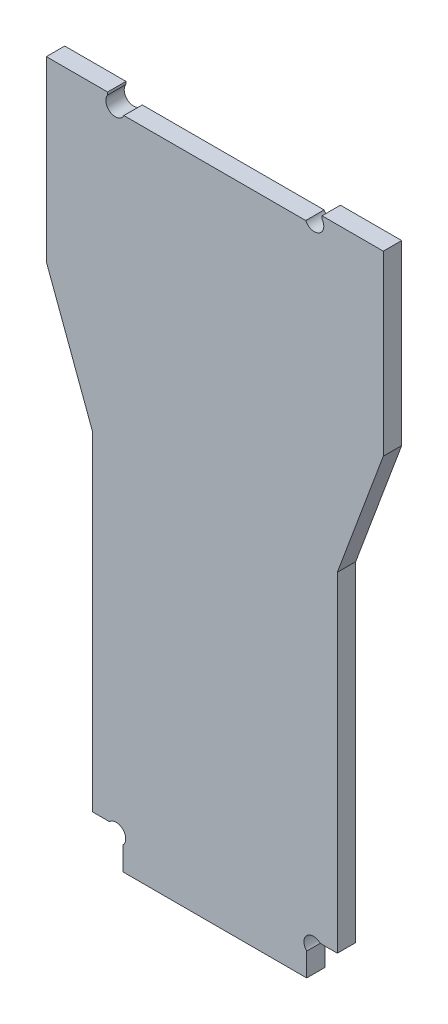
ISO-10303-21;
HEADER;
FILE_DESCRIPTION(('STEP AP214'),'2;1');
FILE_NAME('part.step','',(''),(''),'','','');
FILE_SCHEMA(('AUTOMOTIVE_DESIGN { 1 0 10303 214 1 1 1 1 }'));
ENDSEC;
DATA;
#1=APPLICATION_CONTEXT('core data for automotive mechanical design processes');
#2=APPLICATION_PROTOCOL_DEFINITION('international standard','automotive_design',2000,#1);
#3=PRODUCT_CONTEXT('',#1,'mechanical');
#4=PRODUCT('Part','Part','',(#3));
#5=PRODUCT_RELATED_PRODUCT_CATEGORY('part','',(#4));
#6=PRODUCT_DEFINITION_FORMATION('','',#4);
#7=PRODUCT_DEFINITION_CONTEXT('part definition',#1,'design');
#8=PRODUCT_DEFINITION('design','',#6,#7);
#9=PRODUCT_DEFINITION_SHAPE('','',#8);
#10=(LENGTH_UNIT() NAMED_UNIT(*) SI_UNIT(.MILLI.,.METRE.));
#11=(NAMED_UNIT(*) PLANE_ANGLE_UNIT() SI_UNIT($,.RADIAN.));
#12=(NAMED_UNIT(*) SI_UNIT($,.STERADIAN.) SOLID_ANGLE_UNIT());
#13=UNCERTAINTY_MEASURE_WITH_UNIT(LENGTH_MEASURE(1.E-05),#10,'distance_accuracy_value','');
#14=(GEOMETRIC_REPRESENTATION_CONTEXT(3) GLOBAL_UNCERTAINTY_ASSIGNED_CONTEXT((#13)) GLOBAL_UNIT_ASSIGNED_CONTEXT((#10,
#11,#12)) REPRESENTATION_CONTEXT('',''));
#15=CARTESIAN_POINT('',(0.,0.,0.));
#16=DIRECTION('',(0.,0.,1.));
#17=DIRECTION('',(1.,0.,0.));
#18=AXIS2_PLACEMENT_3D('',#15,#16,#17);
#19=CARTESIAN_POINT('',(25.,80.,3.));
#20=DIRECTION('',(0.937139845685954,0.348954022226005,0.));
#21=DIRECTION('',(-0.348954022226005,0.937139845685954,0.));
#22=AXIS2_PLACEMENT_3D('',#19,#20,#21);
#23=PLANE('',#22);
#24=DIRECTION('',(0.348954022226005,-0.937139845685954,0.));
#25=VECTOR('',#24,1.);
#26=CARTESIAN_POINT('',(25.,80.,0.));
#27=LINE('',#26,#25);
#28=CARTESIAN_POINT('',(25.,80.,0.));
#29=VERTEX_POINT('',#28);
#30=CARTESIAN_POINT('',(32.5,59.8582380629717,0.));
#31=VERTEX_POINT('',#30);
#32=EDGE_CURVE('E166',#29,#31,#27,.T.);
#33=ORIENTED_EDGE('',*,*,#32,.T.);
#34=DIRECTION('',(0.,0.,-1.));
#35=VECTOR('',#34,1.);
#36=CARTESIAN_POINT('',(32.5,59.8582380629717,3.));
#37=LINE('',#36,#35);
#38=CARTESIAN_POINT('',(32.5,59.8582380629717,3.));
#39=VERTEX_POINT('',#38);
#40=EDGE_CURVE('E11',#39,#31,#37,.T.);
#41=ORIENTED_EDGE('',*,*,#40,.F.);
#42=DIRECTION('',(0.348954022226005,-0.937139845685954,0.));
#43=VECTOR('',#42,1.);
#44=CARTESIAN_POINT('',(25.,80.,3.));
#45=LINE('',#44,#43);
#46=CARTESIAN_POINT('',(25.,80.,3.));
#47=VERTEX_POINT('',#46);
#48=EDGE_CURVE('E217',#47,#39,#45,.T.);
#49=ORIENTED_EDGE('',*,*,#48,.F.);
#50=DIRECTION('',(0.,0.,-1.));
#51=VECTOR('',#50,1.);
#52=CARTESIAN_POINT('',(25.,80.,3.));
#53=LINE('',#52,#51);
#54=EDGE_CURVE('E179',#47,#29,#53,.T.);
#55=ORIENTED_EDGE('',*,*,#54,.T.);
#56=EDGE_LOOP('',(#33,#41,#49,#55));
#57=FACE_BOUND('',#56,.T.);
#58=ADVANCED_FACE('F26',(#57),#23,.F.);
#59=CARTESIAN_POINT('',(32.5,6.,3.));
#60=DIRECTION('',(1.,0.,0.));
#61=DIRECTION('',(0.,0.,-1.));
#62=AXIS2_PLACEMENT_3D('',#59,#60,#61);
#63=PLANE('',#62);
#64=DIRECTION('',(0.,-1.,0.));
#65=VECTOR('',#64,1.);
#66=CARTESIAN_POINT('',(32.5,6.,0.));
#67=LINE('',#66,#65);
#68=CARTESIAN_POINT('',(32.5,6.,0.));
#69=VERTEX_POINT('',#68);
#70=EDGE_CURVE('E162',#31,#69,#67,.T.);
#71=ORIENTED_EDGE('',*,*,#70,.T.);
#72=DIRECTION('',(0.,0.,-1.));
#73=VECTOR('',#72,1.);
#74=CARTESIAN_POINT('',(32.5,6.,3.));
#75=LINE('',#74,#73);
#76=CARTESIAN_POINT('',(32.5,6.,3.));
#77=VERTEX_POINT('',#76);
#78=EDGE_CURVE('E33',#77,#69,#75,.T.);
#79=ORIENTED_EDGE('',*,*,#78,.F.);
#80=DIRECTION('',(0.,-1.,0.));
#81=VECTOR('',#80,1.);
#82=CARTESIAN_POINT('',(32.5,6.,3.));
#83=LINE('',#82,#81);
#84=EDGE_CURVE('E175',#39,#77,#83,.T.);
#85=ORIENTED_EDGE('',*,*,#84,.F.);
#86=ORIENTED_EDGE('',*,*,#40,.T.);
#87=EDGE_LOOP('',(#71,#79,#85,#86));
#88=FACE_BOUND('',#87,.T.);
#89=ADVANCED_FACE('F174',(#88),#63,.F.);
#90=CARTESIAN_POINT('',(35.3079689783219,6.,3.));
#91=DIRECTION('',(0.,1.,0.));
#92=DIRECTION('',(0.,0.,1.));
#93=AXIS2_PLACEMENT_3D('',#90,#91,#92);
#94=PLANE('',#93);
#95=DIRECTION('',(1.,0.,0.));
#96=VECTOR('',#95,1.);
#97=CARTESIAN_POINT('',(35.3079689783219,6.,0.));
#98=LINE('',#97,#96);
#99=CARTESIAN_POINT('',(35.3079689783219,6.,0.));
#100=VERTEX_POINT('',#99);
#101=EDGE_CURVE('E168',#69,#100,#98,.T.);
#102=ORIENTED_EDGE('',*,*,#101,.T.);
#103=DIRECTION('',(0.,0.,-1.));
#104=VECTOR('',#103,1.);
#105=CARTESIAN_POINT('',(35.3079689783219,6.,3.));
#106=LINE('',#105,#104);
#107=CARTESIAN_POINT('',(35.3079689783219,6.,3.));
#108=VERTEX_POINT('',#107);
#109=EDGE_CURVE('E303',#108,#100,#106,.T.);
#110=ORIENTED_EDGE('',*,*,#109,.F.);
#111=DIRECTION('',(1.,0.,0.));
#112=VECTOR('',#111,1.);
#113=CARTESIAN_POINT('',(35.3079689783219,6.,3.));
#114=LINE('',#113,#112);
#115=EDGE_CURVE('E220',#77,#108,#114,.T.);
#116=ORIENTED_EDGE('',*,*,#115,.F.);
#117=ORIENTED_EDGE('',*,*,#78,.T.);
#118=EDGE_LOOP('',(#102,#110,#116,#117));
#119=FACE_BOUND('',#118,.T.);
#120=ADVANCED_FACE('F307',(#119),#94,.F.);
#121=CARTESIAN_POINT('',(36.403984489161,4.90398448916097,3.));
#122=DIRECTION('',(0.,0.,-1.));
#123=DIRECTION('',(-1.,0.,0.));
#124=AXIS2_PLACEMENT_3D('',#121,#122,#123);
#125=CYLINDRICAL_SURFACE('',#124,1.54999999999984);
#126=CARTESIAN_POINT('',(36.403984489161,4.90398448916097,0.));
#127=DIRECTION('',(0.,0.,-1.));
#128=DIRECTION('',(1.,0.,0.));
#129=AXIS2_PLACEMENT_3D('',#126,#127,#128);
#130=CIRCLE('',#129,1.54999999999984);
#131=CARTESIAN_POINT('',(37.5,3.80796897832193,0.));
#132=VERTEX_POINT('',#131);
#133=EDGE_CURVE('E183',#100,#132,#130,.T.);
#134=ORIENTED_EDGE('',*,*,#133,.T.);
#135=DIRECTION('',(0.,0.,-1.));
#136=VECTOR('',#135,1.);
#137=CARTESIAN_POINT('',(37.5,3.80796897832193,3.));
#138=LINE('',#137,#136);
#139=CARTESIAN_POINT('',(37.5,3.80796897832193,3.));
#140=VERTEX_POINT('',#139);
#141=EDGE_CURVE('E300',#140,#132,#138,.T.);
#142=ORIENTED_EDGE('',*,*,#141,.F.);
#143=CARTESIAN_POINT('',(36.403984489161,4.90398448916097,3.));
#144=DIRECTION('',(0.,0.,-1.));
#145=DIRECTION('',(1.,0.,0.));
#146=AXIS2_PLACEMENT_3D('',#143,#144,#145);
#147=CIRCLE('',#146,1.54999999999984);
#148=EDGE_CURVE('E222',#108,#140,#147,.T.);
#149=ORIENTED_EDGE('',*,*,#148,.F.);
#150=ORIENTED_EDGE('',*,*,#109,.T.);
#151=EDGE_LOOP('',(#134,#142,#149,#150));
#152=FACE_BOUND('',#151,.T.);
#153=ADVANCED_FACE('F315',(#152),#125,.F.);
#154=CARTESIAN_POINT('',(37.5,0.,3.));
#155=DIRECTION('',(1.,0.,0.));
#156=DIRECTION('',(0.,1.,0.));
#157=AXIS2_PLACEMENT_3D('',#154,#155,#156);
#158=PLANE('',#157);
#159=DIRECTION('',(0.,-1.,0.));
#160=VECTOR('',#159,1.);
#161=CARTESIAN_POINT('',(37.5,0.,0.));
#162=LINE('',#161,#160);
#163=CARTESIAN_POINT('',(37.5,0.,0.));
#164=VERTEX_POINT('',#163);
#165=EDGE_CURVE('E185',#132,#164,#162,.T.);
#166=ORIENTED_EDGE('',*,*,#165,.T.);
#167=DIRECTION('',(0.,0.,-1.));
#168=VECTOR('',#167,1.);
#169=CARTESIAN_POINT('',(37.5,0.,3.));
#170=LINE('',#169,#168);
#171=CARTESIAN_POINT('',(37.5,0.,3.));
#172=VERTEX_POINT('',#171);
#173=EDGE_CURVE('E297',#172,#164,#170,.T.);
#174=ORIENTED_EDGE('',*,*,#173,.F.);
#175=DIRECTION('',(0.,-1.,0.));
#176=VECTOR('',#175,1.);
#177=CARTESIAN_POINT('',(37.5,0.,3.));
#178=LINE('',#177,#176);
#179=EDGE_CURVE('E224',#140,#172,#178,.T.);
#180=ORIENTED_EDGE('',*,*,#179,.F.);
#181=ORIENTED_EDGE('',*,*,#141,.T.);
#182=EDGE_LOOP('',(#166,#174,#180,#181));
#183=FACE_BOUND('',#182,.T.);
#184=ADVANCED_FACE('F318',(#183),#158,.F.);
#185=CARTESIAN_POINT('',(67.5,0.,3.));
#186=DIRECTION('',(0.,1.,0.));
#187=DIRECTION('',(-1.,0.,0.));
#188=AXIS2_PLACEMENT_3D('',#185,#186,#187);
#189=PLANE('',#188);
#190=DIRECTION('',(1.,0.,0.));
#191=VECTOR('',#190,1.);
#192=CARTESIAN_POINT('',(67.5,0.,0.));
#193=LINE('',#192,#191);
#194=CARTESIAN_POINT('',(67.5,0.,0.));
#195=VERTEX_POINT('',#194);
#196=EDGE_CURVE('E187',#164,#195,#193,.T.);
#197=ORIENTED_EDGE('',*,*,#196,.T.);
#198=DIRECTION('',(0.,0.,-1.));
#199=VECTOR('',#198,1.);
#200=CARTESIAN_POINT('',(67.5,0.,3.));
#201=LINE('',#200,#199);
#202=CARTESIAN_POINT('',(67.5,0.,3.));
#203=VERTEX_POINT('',#202);
#204=EDGE_CURVE('E294',#203,#195,#201,.T.);
#205=ORIENTED_EDGE('',*,*,#204,.F.);
#206=DIRECTION('',(1.,0.,0.));
#207=VECTOR('',#206,1.);
#208=CARTESIAN_POINT('',(67.5,0.,3.));
#209=LINE('',#208,#207);
#210=EDGE_CURVE('E226',#172,#203,#209,.T.);
#211=ORIENTED_EDGE('',*,*,#210,.F.);
#212=ORIENTED_EDGE('',*,*,#173,.T.);
#213=EDGE_LOOP('',(#197,#205,#211,#212));
#214=FACE_BOUND('',#213,.T.);
#215=ADVANCED_FACE('F323',(#214),#189,.F.);
#216=CARTESIAN_POINT('',(67.5,0.,3.));
#217=DIRECTION('',(-1.,0.,0.));
#218=DIRECTION('',(0.,0.,1.));
#219=AXIS2_PLACEMENT_3D('',#216,#217,#218);
#220=PLANE('',#219);
#221=DIRECTION('',(0.,1.,0.));
#222=VECTOR('',#221,1.);
#223=CARTESIAN_POINT('',(67.5,0.,0.));
#224=LINE('',#223,#222);
#225=CARTESIAN_POINT('',(67.5,3.80796897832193,0.));
#226=VERTEX_POINT('',#225);
#227=EDGE_CURVE('E189',#195,#226,#224,.T.);
#228=ORIENTED_EDGE('',*,*,#227,.T.);
#229=DIRECTION('',(0.,0.,-1.));
#230=VECTOR('',#229,1.);
#231=CARTESIAN_POINT('',(67.5,3.80796897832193,3.));
#232=LINE('',#231,#230);
#233=CARTESIAN_POINT('',(67.5,3.80796897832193,3.));
#234=VERTEX_POINT('',#233);
#235=EDGE_CURVE('E291',#234,#226,#232,.T.);
#236=ORIENTED_EDGE('',*,*,#235,.F.);
#237=DIRECTION('',(0.,1.,0.));
#238=VECTOR('',#237,1.);
#239=CARTESIAN_POINT('',(67.5,0.,3.));
#240=LINE('',#239,#238);
#241=EDGE_CURVE('E228',#203,#234,#240,.T.);
#242=ORIENTED_EDGE('',*,*,#241,.F.);
#243=ORIENTED_EDGE('',*,*,#204,.T.);
#244=EDGE_LOOP('',(#228,#236,#242,#243));
#245=FACE_BOUND('',#244,.T.);
#246=ADVANCED_FACE('F329',(#245),#220,.F.);
#247=CARTESIAN_POINT('',(68.596015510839,4.90398448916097,3.));
#248=DIRECTION('',(0.,0.,-1.));
#249=DIRECTION('',(-1.,0.,0.));
#250=AXIS2_PLACEMENT_3D('',#247,#248,#249);
#251=CYLINDRICAL_SURFACE('',#250,1.54999999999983);
#252=CARTESIAN_POINT('',(68.596015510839,4.90398448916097,0.));
#253=DIRECTION('',(0.,0.,-1.));
#254=DIRECTION('',(-1.,0.,0.));
#255=AXIS2_PLACEMENT_3D('',#252,#253,#254);
#256=CIRCLE('',#255,1.54999999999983);
#257=CARTESIAN_POINT('',(69.692031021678,6.,0.));
#258=VERTEX_POINT('',#257);
#259=EDGE_CURVE('E191',#226,#258,#256,.T.);
#260=ORIENTED_EDGE('',*,*,#259,.T.);
#261=DIRECTION('',(0.,0.,-1.));
#262=VECTOR('',#261,1.);
#263=CARTESIAN_POINT('',(69.692031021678,6.,3.));
#264=LINE('',#263,#262);
#265=CARTESIAN_POINT('',(69.692031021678,6.,3.));
#266=VERTEX_POINT('',#265);
#267=EDGE_CURVE('E288',#266,#258,#264,.T.);
#268=ORIENTED_EDGE('',*,*,#267,.F.);
#269=CARTESIAN_POINT('',(68.596015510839,4.90398448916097,3.));
#270=DIRECTION('',(0.,0.,-1.));
#271=DIRECTION('',(-1.,0.,0.));
#272=AXIS2_PLACEMENT_3D('',#269,#270,#271);
#273=CIRCLE('',#272,1.54999999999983);
#274=EDGE_CURVE('E230',#234,#266,#273,.T.);
#275=ORIENTED_EDGE('',*,*,#274,.F.);
#276=ORIENTED_EDGE('',*,*,#235,.T.);
#277=EDGE_LOOP('',(#260,#268,#275,#276));
#278=FACE_BOUND('',#277,.T.);
#279=ADVANCED_FACE('F333',(#278),#251,.F.);
#280=CARTESIAN_POINT('',(69.692031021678,6.,3.));
#281=DIRECTION('',(0.,1.,0.));
#282=DIRECTION('',(0.,0.,1.));
#283=AXIS2_PLACEMENT_3D('',#280,#281,#282);
#284=PLANE('',#283);
#285=DIRECTION('',(1.,0.,0.));
#286=VECTOR('',#285,1.);
#287=CARTESIAN_POINT('',(69.692031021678,6.,0.));
#288=LINE('',#287,#286);
#289=CARTESIAN_POINT('',(72.5,6.,0.));
#290=VERTEX_POINT('',#289);
#291=EDGE_CURVE('E193',#258,#290,#288,.T.);
#292=ORIENTED_EDGE('',*,*,#291,.T.);
#293=DIRECTION('',(0.,0.,-1.));
#294=VECTOR('',#293,1.);
#295=CARTESIAN_POINT('',(72.5,6.,3.));
#296=LINE('',#295,#294);
#297=CARTESIAN_POINT('',(72.5,6.,3.));
#298=VERTEX_POINT('',#297);
#299=EDGE_CURVE('E285',#298,#290,#296,.T.);
#300=ORIENTED_EDGE('',*,*,#299,.F.);
#301=DIRECTION('',(1.,0.,0.));
#302=VECTOR('',#301,1.);
#303=CARTESIAN_POINT('',(69.692031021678,6.,3.));
#304=LINE('',#303,#302);
#305=EDGE_CURVE('E232',#266,#298,#304,.T.);
#306=ORIENTED_EDGE('',*,*,#305,.F.);
#307=ORIENTED_EDGE('',*,*,#267,.T.);
#308=EDGE_LOOP('',(#292,#300,#306,#307));
#309=FACE_BOUND('',#308,.T.);
#310=ADVANCED_FACE('F338',(#309),#284,.F.);
#311=CARTESIAN_POINT('',(72.5,6.,3.));
#312=DIRECTION('',(-1.,0.,0.));
#313=DIRECTION('',(0.,0.,1.));
#314=AXIS2_PLACEMENT_3D('',#311,#312,#313);
#315=PLANE('',#314);
#316=DIRECTION('',(0.,1.,0.));
#317=VECTOR('',#316,1.);
#318=CARTESIAN_POINT('',(72.5,6.,0.));
#319=LINE('',#318,#317);
#320=CARTESIAN_POINT('',(72.5,59.8582380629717,0.));
#321=VERTEX_POINT('',#320);
#322=EDGE_CURVE('E195',#290,#321,#319,.T.);
#323=ORIENTED_EDGE('',*,*,#322,.T.);
#324=DIRECTION('',(0.,0.,-1.));
#325=VECTOR('',#324,1.);
#326=CARTESIAN_POINT('',(72.5,59.8582380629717,3.));
#327=LINE('',#326,#325);
#328=CARTESIAN_POINT('',(72.5,59.8582380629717,3.));
#329=VERTEX_POINT('',#328);
#330=EDGE_CURVE('E282',#329,#321,#327,.T.);
#331=ORIENTED_EDGE('',*,*,#330,.F.);
#332=DIRECTION('',(0.,1.,0.));
#333=VECTOR('',#332,1.);
#334=CARTESIAN_POINT('',(72.5,6.,3.));
#335=LINE('',#334,#333);
#336=EDGE_CURVE('E234',#298,#329,#335,.T.);
#337=ORIENTED_EDGE('',*,*,#336,.F.);
#338=ORIENTED_EDGE('',*,*,#299,.T.);
#339=EDGE_LOOP('',(#323,#331,#337,#338));
#340=FACE_BOUND('',#339,.T.);
#341=ADVANCED_FACE('F344',(#340),#315,.F.);
#342=CARTESIAN_POINT('',(80.,80.,3.));
#343=DIRECTION('',(-0.937139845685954,0.348954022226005,0.));
#344=DIRECTION('',(-0.348954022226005,-0.937139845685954,0.));
#345=AXIS2_PLACEMENT_3D('',#342,#343,#344);
#346=PLANE('',#345);
#347=DIRECTION('',(0.348954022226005,0.937139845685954,0.));
#348=VECTOR('',#347,1.);
#349=CARTESIAN_POINT('',(80.,80.,0.));
#350=LINE('',#349,#348);
#351=CARTESIAN_POINT('',(80.,80.,0.));
#352=VERTEX_POINT('',#351);
#353=EDGE_CURVE('E197',#321,#352,#350,.T.);
#354=ORIENTED_EDGE('',*,*,#353,.T.);
#355=DIRECTION('',(0.,0.,-1.));
#356=VECTOR('',#355,1.);
#357=CARTESIAN_POINT('',(80.,80.,3.));
#358=LINE('',#357,#356);
#359=CARTESIAN_POINT('',(80.,80.,3.));
#360=VERTEX_POINT('',#359);
#361=EDGE_CURVE('E279',#360,#352,#358,.T.);
#362=ORIENTED_EDGE('',*,*,#361,.F.);
#363=DIRECTION('',(0.348954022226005,0.937139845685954,0.));
#364=VECTOR('',#363,1.);
#365=CARTESIAN_POINT('',(80.,80.,3.));
#366=LINE('',#365,#364);
#367=EDGE_CURVE('E236',#329,#360,#366,.T.);
#368=ORIENTED_EDGE('',*,*,#367,.F.);
#369=ORIENTED_EDGE('',*,*,#330,.T.);
#370=EDGE_LOOP('',(#354,#362,#368,#369));
#371=FACE_BOUND('',#370,.T.);
#372=ADVANCED_FACE('F348',(#371),#346,.F.);
#373=CARTESIAN_POINT('',(80.,109.,3.));
#374=DIRECTION('',(-1.,0.,0.));
#375=DIRECTION('',(0.,0.,1.));
#376=AXIS2_PLACEMENT_3D('',#373,#374,#375);
#377=PLANE('',#376);
#378=DIRECTION('',(0.,1.,0.));
#379=VECTOR('',#378,1.);
#380=CARTESIAN_POINT('',(80.,109.,0.));
#381=LINE('',#380,#379);
#382=CARTESIAN_POINT('',(80.,109.,0.));
#383=VERTEX_POINT('',#382);
#384=EDGE_CURVE('E199',#352,#383,#381,.T.);
#385=ORIENTED_EDGE('',*,*,#384,.T.);
#386=DIRECTION('',(0.,0.,-1.));
#387=VECTOR('',#386,1.);
#388=CARTESIAN_POINT('',(80.,109.,3.));
#389=LINE('',#388,#387);
#390=CARTESIAN_POINT('',(80.,109.,3.));
#391=VERTEX_POINT('',#390);
#392=EDGE_CURVE('E276',#391,#383,#389,.T.);
#393=ORIENTED_EDGE('',*,*,#392,.F.);
#394=DIRECTION('',(0.,1.,0.));
#395=VECTOR('',#394,1.);
#396=CARTESIAN_POINT('',(80.,109.,3.));
#397=LINE('',#396,#395);
#398=EDGE_CURVE('E238',#360,#391,#397,.T.);
#399=ORIENTED_EDGE('',*,*,#398,.F.);
#400=ORIENTED_EDGE('',*,*,#361,.T.);
#401=EDGE_LOOP('',(#385,#393,#399,#400));
#402=FACE_BOUND('',#401,.T.);
#403=ADVANCED_FACE('F353',(#402),#377,.F.);
#404=CARTESIAN_POINT('',(70.,109.,3.));
#405=DIRECTION('',(0.,-1.,0.));
#406=DIRECTION('',(0.,0.,-1.));
#407=AXIS2_PLACEMENT_3D('',#404,#405,#406);
#408=PLANE('',#407);
#409=DIRECTION('',(-1.,0.,0.));
#410=VECTOR('',#409,1.);
#411=CARTESIAN_POINT('',(70.,109.,0.));
#412=LINE('',#411,#410);
#413=CARTESIAN_POINT('',(70.,109.,0.));
#414=VERTEX_POINT('',#413);
#415=EDGE_CURVE('E201',#383,#414,#412,.T.);
#416=ORIENTED_EDGE('',*,*,#415,.T.);
#417=DIRECTION('',(0.,0.,-1.));
#418=VECTOR('',#417,1.);
#419=CARTESIAN_POINT('',(70.,109.,3.));
#420=LINE('',#419,#418);
#421=CARTESIAN_POINT('',(70.,109.,3.));
#422=VERTEX_POINT('',#421);
#423=EDGE_CURVE('E273',#422,#414,#420,.T.);
#424=ORIENTED_EDGE('',*,*,#423,.F.);
#425=DIRECTION('',(-1.,0.,0.));
#426=VECTOR('',#425,1.);
#427=CARTESIAN_POINT('',(70.,109.,3.));
#428=LINE('',#427,#426);
#429=EDGE_CURVE('E240',#391,#422,#428,.T.);
#430=ORIENTED_EDGE('',*,*,#429,.F.);
#431=ORIENTED_EDGE('',*,*,#392,.T.);
#432=EDGE_LOOP('',(#416,#424,#430,#431));
#433=FACE_BOUND('',#432,.T.);
#434=ADVANCED_FACE('F359',(#433),#408,.F.);
#435=CARTESIAN_POINT('',(70.,109.,3.));
#436=DIRECTION('',(1.,0.,0.));
#437=DIRECTION('',(0.,0.,-1.));
#438=AXIS2_PLACEMENT_3D('',#435,#436,#437);
#439=PLANE('',#438);
#440=DIRECTION('',(0.,-1.,0.));
#441=VECTOR('',#440,1.);
#442=CARTESIAN_POINT('',(70.,109.,0.));
#443=LINE('',#442,#441);
#444=CARTESIAN_POINT('',(70.,108.574329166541,0.));
#445=VERTEX_POINT('',#444);
#446=EDGE_CURVE('E203',#414,#445,#443,.T.);
#447=ORIENTED_EDGE('',*,*,#446,.T.);
#448=DIRECTION('',(0.,0.,-1.));
#449=VECTOR('',#448,1.);
#450=CARTESIAN_POINT('',(70.,108.574329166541,3.));
#451=LINE('',#450,#449);
#452=CARTESIAN_POINT('',(70.,108.574329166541,3.));
#453=VERTEX_POINT('',#452);
#454=EDGE_CURVE('E270',#453,#445,#451,.T.);
#455=ORIENTED_EDGE('',*,*,#454,.F.);
#456=DIRECTION('',(0.,-1.,0.));
#457=VECTOR('',#456,1.);
#458=CARTESIAN_POINT('',(70.,109.,3.));
#459=LINE('',#458,#457);
#460=EDGE_CURVE('E242',#422,#453,#459,.T.);
#461=ORIENTED_EDGE('',*,*,#460,.F.);
#462=ORIENTED_EDGE('',*,*,#423,.T.);
#463=EDGE_LOOP('',(#447,#455,#461,#462));
#464=FACE_BOUND('',#463,.T.);
#465=ADVANCED_FACE('F363',(#464),#439,.F.);
#466=CARTESIAN_POINT('',(68.7391374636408,107.672816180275,3.));
#467=DIRECTION('',(0.,0.,-1.));
#468=DIRECTION('',(-1.,0.,0.));
#469=AXIS2_PLACEMENT_3D('',#466,#467,#468);
#470=CYLINDRICAL_SURFACE('',#469,1.55);
#471=CARTESIAN_POINT('',(68.7391374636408,107.672816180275,0.));
#472=DIRECTION('',(0.,0.,-1.));
#473=DIRECTION('',(-1.,0.,0.));
#474=AXIS2_PLACEMENT_3D('',#471,#472,#473);
#475=CIRCLE('',#474,1.55);
#476=CARTESIAN_POINT('',(67.342778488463,107.,0.));
#477=VERTEX_POINT('',#476);
#478=EDGE_CURVE('E205',#445,#477,#475,.T.);
#479=ORIENTED_EDGE('',*,*,#478,.T.);
#480=DIRECTION('',(0.,0.,-1.));
#481=VECTOR('',#480,1.);
#482=CARTESIAN_POINT('',(67.342778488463,107.,3.));
#483=LINE('',#482,#481);
#484=CARTESIAN_POINT('',(67.342778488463,107.,3.));
#485=VERTEX_POINT('',#484);
#486=EDGE_CURVE('E267',#485,#477,#483,.T.);
#487=ORIENTED_EDGE('',*,*,#486,.F.);
#488=CARTESIAN_POINT('',(68.7391374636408,107.672816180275,3.));
#489=DIRECTION('',(0.,0.,-1.));
#490=DIRECTION('',(-1.,0.,0.));
#491=AXIS2_PLACEMENT_3D('',#488,#489,#490);
#492=CIRCLE('',#491,1.55);
#493=EDGE_CURVE('E244',#453,#485,#492,.T.);
#494=ORIENTED_EDGE('',*,*,#493,.F.);
#495=ORIENTED_EDGE('',*,*,#454,.T.);
#496=EDGE_LOOP('',(#479,#487,#494,#495));
#497=FACE_BOUND('',#496,.T.);
#498=ADVANCED_FACE('F368',(#497),#470,.F.);
#499=CARTESIAN_POINT('',(37.657221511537,107.,3.));
#500=DIRECTION('',(0.,-1.,0.));
#501=DIRECTION('',(0.,0.,-1.));
#502=AXIS2_PLACEMENT_3D('',#499,#500,#501);
#503=PLANE('',#502);
#504=DIRECTION('',(-1.,0.,0.));
#505=VECTOR('',#504,1.);
#506=CARTESIAN_POINT('',(37.657221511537,107.,0.));
#507=LINE('',#506,#505);
#508=CARTESIAN_POINT('',(37.657221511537,107.,0.));
#509=VERTEX_POINT('',#508);
#510=EDGE_CURVE('E207',#477,#509,#507,.T.);
#511=ORIENTED_EDGE('',*,*,#510,.T.);
#512=DIRECTION('',(0.,0.,-1.));
#513=VECTOR('',#512,1.);
#514=CARTESIAN_POINT('',(37.657221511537,107.,3.));
#515=LINE('',#514,#513);
#516=CARTESIAN_POINT('',(37.657221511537,107.,3.));
#517=VERTEX_POINT('',#516);
#518=EDGE_CURVE('E264',#517,#509,#515,.T.);
#519=ORIENTED_EDGE('',*,*,#518,.F.);
#520=DIRECTION('',(-1.,0.,0.));
#521=VECTOR('',#520,1.);
#522=CARTESIAN_POINT('',(37.657221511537,107.,3.));
#523=LINE('',#522,#521);
#524=EDGE_CURVE('E246',#485,#517,#523,.T.);
#525=ORIENTED_EDGE('',*,*,#524,.F.);
#526=ORIENTED_EDGE('',*,*,#486,.T.);
#527=EDGE_LOOP('',(#511,#519,#525,#526));
#528=FACE_BOUND('',#527,.T.);
#529=ADVANCED_FACE('F374',(#528),#503,.F.);
#530=CARTESIAN_POINT('',(36.2608625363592,107.672816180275,3.));
#531=DIRECTION('',(0.,0.,-1.));
#532=DIRECTION('',(-1.,0.,0.));
#533=AXIS2_PLACEMENT_3D('',#530,#531,#532);
#534=CYLINDRICAL_SURFACE('',#533,1.55);
#535=CARTESIAN_POINT('',(36.2608625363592,107.672816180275,0.));
#536=DIRECTION('',(0.,0.,-1.));
#537=DIRECTION('',(1.,0.,0.));
#538=AXIS2_PLACEMENT_3D('',#535,#536,#537);
#539=CIRCLE('',#538,1.55);
#540=CARTESIAN_POINT('',(35.,108.574329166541,0.));
#541=VERTEX_POINT('',#540);
#542=EDGE_CURVE('E209',#509,#541,#539,.T.);
#543=ORIENTED_EDGE('',*,*,#542,.T.);
#544=DIRECTION('',(0.,0.,-1.));
#545=VECTOR('',#544,1.);
#546=CARTESIAN_POINT('',(35.,108.574329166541,3.));
#547=LINE('',#546,#545);
#548=CARTESIAN_POINT('',(35.,108.574329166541,3.));
#549=VERTEX_POINT('',#548);
#550=EDGE_CURVE('E261',#549,#541,#547,.T.);
#551=ORIENTED_EDGE('',*,*,#550,.F.);
#552=CARTESIAN_POINT('',(36.2608625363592,107.672816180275,3.));
#553=DIRECTION('',(0.,0.,-1.));
#554=DIRECTION('',(1.,0.,0.));
#555=AXIS2_PLACEMENT_3D('',#552,#553,#554);
#556=CIRCLE('',#555,1.55);
#557=EDGE_CURVE('E248',#517,#549,#556,.T.);
#558=ORIENTED_EDGE('',*,*,#557,.F.);
#559=ORIENTED_EDGE('',*,*,#518,.T.);
#560=EDGE_LOOP('',(#543,#551,#558,#559));
#561=FACE_BOUND('',#560,.T.);
#562=ADVANCED_FACE('F378',(#561),#534,.F.);
#563=CARTESIAN_POINT('',(35.,109.,3.));
#564=DIRECTION('',(-1.,0.,0.));
#565=DIRECTION('',(0.,0.,1.));
#566=AXIS2_PLACEMENT_3D('',#563,#564,#565);
#567=PLANE('',#566);
#568=DIRECTION('',(0.,1.,0.));
#569=VECTOR('',#568,1.);
#570=CARTESIAN_POINT('',(35.,109.,0.));
#571=LINE('',#570,#569);
#572=CARTESIAN_POINT('',(35.,109.,0.));
#573=VERTEX_POINT('',#572);
#574=EDGE_CURVE('E211',#541,#573,#571,.T.);
#575=ORIENTED_EDGE('',*,*,#574,.T.);
#576=DIRECTION('',(0.,0.,-1.));
#577=VECTOR('',#576,1.);
#578=CARTESIAN_POINT('',(35.,109.,3.));
#579=LINE('',#578,#577);
#580=CARTESIAN_POINT('',(35.,109.,3.));
#581=VERTEX_POINT('',#580);
#582=EDGE_CURVE('E258',#581,#573,#579,.T.);
#583=ORIENTED_EDGE('',*,*,#582,.F.);
#584=DIRECTION('',(0.,1.,0.));
#585=VECTOR('',#584,1.);
#586=CARTESIAN_POINT('',(35.,109.,3.));
#587=LINE('',#586,#585);
#588=EDGE_CURVE('E250',#549,#581,#587,.T.);
#589=ORIENTED_EDGE('',*,*,#588,.F.);
#590=ORIENTED_EDGE('',*,*,#550,.T.);
#591=EDGE_LOOP('',(#575,#583,#589,#590));
#592=FACE_BOUND('',#591,.T.);
#593=ADVANCED_FACE('F383',(#592),#567,.F.);
#594=CARTESIAN_POINT('',(35.,109.,3.));
#595=DIRECTION('',(0.,-1.,0.));
#596=DIRECTION('',(0.,0.,-1.));
#597=AXIS2_PLACEMENT_3D('',#594,#595,#596);
#598=PLANE('',#597);
#599=DIRECTION('',(-1.,0.,0.));
#600=VECTOR('',#599,1.);
#601=CARTESIAN_POINT('',(35.,109.,0.));
#602=LINE('',#601,#600);
#603=CARTESIAN_POINT('',(25.,109.,0.));
#604=VERTEX_POINT('',#603);
#605=EDGE_CURVE('E213',#573,#604,#602,.T.);
#606=ORIENTED_EDGE('',*,*,#605,.T.);
#607=DIRECTION('',(0.,0.,-1.));
#608=VECTOR('',#607,1.);
#609=CARTESIAN_POINT('',(25.,109.,3.));
#610=LINE('',#609,#608);
#611=CARTESIAN_POINT('',(25.,109.,3.));
#612=VERTEX_POINT('',#611);
#613=EDGE_CURVE('E255',#612,#604,#610,.T.);
#614=ORIENTED_EDGE('',*,*,#613,.F.);
#615=DIRECTION('',(-1.,0.,0.));
#616=VECTOR('',#615,1.);
#617=CARTESIAN_POINT('',(35.,109.,3.));
#618=LINE('',#617,#616);
#619=EDGE_CURVE('E45',#581,#612,#618,.T.);
#620=ORIENTED_EDGE('',*,*,#619,.F.);
#621=ORIENTED_EDGE('',*,*,#582,.T.);
#622=EDGE_LOOP('',(#606,#614,#620,#621));
#623=FACE_BOUND('',#622,.T.);
#624=ADVANCED_FACE('F386',(#623),#598,.F.);
#625=CARTESIAN_POINT('',(25.,109.,3.));
#626=DIRECTION('',(1.,0.,0.));
#627=DIRECTION('',(0.,0.,-1.));
#628=AXIS2_PLACEMENT_3D('',#625,#626,#627);
#629=PLANE('',#628);
#630=DIRECTION('',(0.,-1.,0.));
#631=VECTOR('',#630,1.);
#632=CARTESIAN_POINT('',(25.,109.,0.));
#633=LINE('',#632,#631);
#634=EDGE_CURVE('E215',#604,#29,#633,.T.);
#635=ORIENTED_EDGE('',*,*,#634,.T.);
#636=ORIENTED_EDGE('',*,*,#54,.F.);
#637=DIRECTION('',(0.,-1.,0.));
#638=VECTOR('',#637,1.);
#639=CARTESIAN_POINT('',(25.,109.,3.));
#640=LINE('',#639,#638);
#641=EDGE_CURVE('E40',#612,#47,#640,.T.);
#642=ORIENTED_EDGE('',*,*,#641,.F.);
#643=ORIENTED_EDGE('',*,*,#613,.T.);
#644=EDGE_LOOP('',(#635,#636,#642,#643));
#645=FACE_BOUND('',#644,.T.);
#646=ADVANCED_FACE('F388',(#645),#629,.F.);
#647=CARTESIAN_POINT('',(36.403984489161,4.90398448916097,3.));
#648=DIRECTION('',(0.,0.,1.));
#649=DIRECTION('',(1.,0.,0.));
#650=AXIS2_PLACEMENT_3D('',#647,#648,#649);
#651=PLANE('',#650);
#652=ORIENTED_EDGE('',*,*,#48,.T.);
#653=ORIENTED_EDGE('',*,*,#84,.T.);
#654=ORIENTED_EDGE('',*,*,#115,.T.);
#655=ORIENTED_EDGE('',*,*,#148,.T.);
#656=ORIENTED_EDGE('',*,*,#179,.T.);
#657=ORIENTED_EDGE('',*,*,#210,.T.);
#658=ORIENTED_EDGE('',*,*,#241,.T.);
#659=ORIENTED_EDGE('',*,*,#274,.T.);
#660=ORIENTED_EDGE('',*,*,#305,.T.);
#661=ORIENTED_EDGE('',*,*,#336,.T.);
#662=ORIENTED_EDGE('',*,*,#367,.T.);
#663=ORIENTED_EDGE('',*,*,#398,.T.);
#664=ORIENTED_EDGE('',*,*,#429,.T.);
#665=ORIENTED_EDGE('',*,*,#460,.T.);
#666=ORIENTED_EDGE('',*,*,#493,.T.);
#667=ORIENTED_EDGE('',*,*,#524,.T.);
#668=ORIENTED_EDGE('',*,*,#557,.T.);
#669=ORIENTED_EDGE('',*,*,#588,.T.);
#670=ORIENTED_EDGE('',*,*,#619,.T.);
#671=ORIENTED_EDGE('',*,*,#641,.T.);
#672=EDGE_LOOP('',(#652,#653,#654,#655,#656,#657,#658,#659,#660,#661,#662,#663,#664,#665,#666,
#667,#668,#669,#670,#671));
#673=FACE_BOUND('',#672,.T.);
#674=ADVANCED_FACE('F310',(#673),#651,.T.);
#675=CARTESIAN_POINT('',(36.403984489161,4.90398448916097,0.));
#676=DIRECTION('',(0.,0.,1.));
#677=DIRECTION('',(1.,0.,0.));
#678=AXIS2_PLACEMENT_3D('',#675,#676,#677);
#679=PLANE('',#678);
#680=ORIENTED_EDGE('',*,*,#32,.F.);
#681=ORIENTED_EDGE('',*,*,#634,.F.);
#682=ORIENTED_EDGE('',*,*,#605,.F.);
#683=ORIENTED_EDGE('',*,*,#574,.F.);
#684=ORIENTED_EDGE('',*,*,#542,.F.);
#685=ORIENTED_EDGE('',*,*,#510,.F.);
#686=ORIENTED_EDGE('',*,*,#478,.F.);
#687=ORIENTED_EDGE('',*,*,#446,.F.);
#688=ORIENTED_EDGE('',*,*,#415,.F.);
#689=ORIENTED_EDGE('',*,*,#384,.F.);
#690=ORIENTED_EDGE('',*,*,#353,.F.);
#691=ORIENTED_EDGE('',*,*,#322,.F.);
#692=ORIENTED_EDGE('',*,*,#291,.F.);
#693=ORIENTED_EDGE('',*,*,#259,.F.);
#694=ORIENTED_EDGE('',*,*,#227,.F.);
#695=ORIENTED_EDGE('',*,*,#196,.F.);
#696=ORIENTED_EDGE('',*,*,#165,.F.);
#697=ORIENTED_EDGE('',*,*,#133,.F.);
#698=ORIENTED_EDGE('',*,*,#101,.F.);
#699=ORIENTED_EDGE('',*,*,#70,.F.);
#700=EDGE_LOOP('',(#680,#681,#682,#683,#684,#685,#686,#687,#688,#689,#690,#691,#692,#693,#694,
#695,#696,#697,#698,#699));
#701=FACE_BOUND('',#700,.T.);
#702=ADVANCED_FACE('F163',(#701),#679,.F.);
#703=CLOSED_SHELL('',(#58,#89,#120,#153,#184,#215,#246,#279,#310,#341,#372,#403,#434,#465,#498,
#529,#562,#593,#624,#646,#674,#702));
#704=MANIFOLD_SOLID_BREP('B2',#703);
#705=ADVANCED_BREP_SHAPE_REPRESENTATION('',(#18,#704),#14);
#706=SHAPE_DEFINITION_REPRESENTATION(#9,#705);
ENDSEC;
END-ISO-10303-21;
